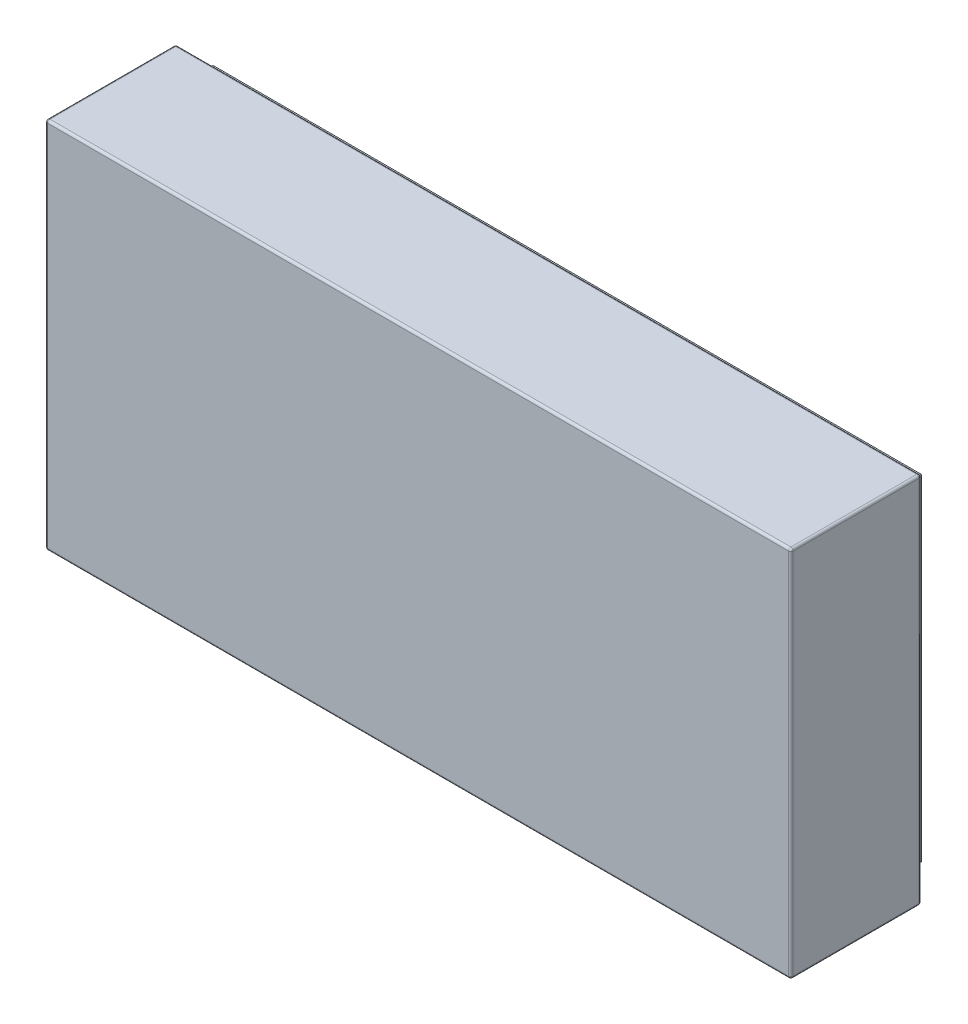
ISO-10303-21;
HEADER;
FILE_DESCRIPTION(('STEP AP214'),'2;1');
FILE_NAME('part.step','',(''),(''),'','','');
FILE_SCHEMA(('AUTOMOTIVE_DESIGN { 1 0 10303 214 1 1 1 1 }'));
ENDSEC;
DATA;
#1=APPLICATION_CONTEXT('core data for automotive mechanical design processes');
#2=APPLICATION_PROTOCOL_DEFINITION('international standard','automotive_design',2000,#1);
#3=PRODUCT_CONTEXT('',#1,'mechanical');
#4=PRODUCT('Part','Part','',(#3));
#5=PRODUCT_RELATED_PRODUCT_CATEGORY('part','',(#4));
#6=PRODUCT_DEFINITION_FORMATION('','',#4);
#7=PRODUCT_DEFINITION_CONTEXT('part definition',#1,'design');
#8=PRODUCT_DEFINITION('design','',#6,#7);
#9=PRODUCT_DEFINITION_SHAPE('','',#8);
#10=(LENGTH_UNIT() NAMED_UNIT(*) SI_UNIT(.MILLI.,.METRE.));
#11=(NAMED_UNIT(*) PLANE_ANGLE_UNIT() SI_UNIT($,.RADIAN.));
#12=(NAMED_UNIT(*) SI_UNIT($,.STERADIAN.) SOLID_ANGLE_UNIT());
#13=UNCERTAINTY_MEASURE_WITH_UNIT(LENGTH_MEASURE(1.E-05),#10,'distance_accuracy_value','');
#14=(GEOMETRIC_REPRESENTATION_CONTEXT(3) GLOBAL_UNCERTAINTY_ASSIGNED_CONTEXT((#13)) GLOBAL_UNIT_ASSIGNED_CONTEXT((#10,
#11,#12)) REPRESENTATION_CONTEXT('',''));
#15=CARTESIAN_POINT('',(0.,0.,0.));
#16=DIRECTION('',(0.,0.,1.));
#17=DIRECTION('',(1.,0.,0.));
#18=AXIS2_PLACEMENT_3D('',#15,#16,#17);
#19=CARTESIAN_POINT('',(0.,8.,0.));
#20=DIRECTION('',(0.,0.,-1.));
#21=DIRECTION('',(-1.,0.,0.));
#22=AXIS2_PLACEMENT_3D('',#19,#20,#21);
#23=PLANE('',#22);
#24=DIRECTION('',(-1.,0.,0.));
#25=VECTOR('',#24,1.);
#26=CARTESIAN_POINT('',(-6.05544306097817,7.6,0.));
#27=LINE('',#26,#25);
#28=CARTESIAN_POINT('',(15.6,7.6,0.));
#29=VERTEX_POINT('',#28);
#30=CARTESIAN_POINT('',(0.400000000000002,7.6,0.));
#31=VERTEX_POINT('',#30);
#32=EDGE_CURVE('E179',#29,#31,#27,.T.);
#33=ORIENTED_EDGE('',*,*,#32,.F.);
#34=DIRECTION('',(0.,-1.,0.));
#35=VECTOR('',#34,1.);
#36=CARTESIAN_POINT('',(15.6,3.99999999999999,0.));
#37=LINE('',#36,#35);
#38=CARTESIAN_POINT('',(15.6,0.400000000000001,0.));
#39=VERTEX_POINT('',#38);
#40=EDGE_CURVE('E184',#29,#39,#37,.T.);
#41=ORIENTED_EDGE('',*,*,#40,.T.);
#42=DIRECTION('',(-1.,0.,0.));
#43=VECTOR('',#42,1.);
#44=CARTESIAN_POINT('',(-6.05544306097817,0.4,0.));
#45=LINE('',#44,#43);
#46=CARTESIAN_POINT('',(0.399999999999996,0.4,0.));
#47=VERTEX_POINT('',#46);
#48=EDGE_CURVE('E164',#39,#47,#45,.T.);
#49=ORIENTED_EDGE('',*,*,#48,.T.);
#50=DIRECTION('',(0.,-1.,0.));
#51=VECTOR('',#50,1.);
#52=CARTESIAN_POINT('',(0.399999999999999,3.99999999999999,0.));
#53=LINE('',#52,#51);
#54=EDGE_CURVE('E175',#31,#47,#53,.T.);
#55=ORIENTED_EDGE('',*,*,#54,.F.);
#56=EDGE_LOOP('',(#33,#41,#49,#55));
#57=FACE_BOUND('',#56,.T.);
#58=DIRECTION('',(0.,-1.,0.));
#59=VECTOR('',#58,1.);
#60=CARTESIAN_POINT('',(14.4,6.4,0.));
#61=LINE('',#60,#59);
#62=CARTESIAN_POINT('',(14.4,6.4,0.));
#63=VERTEX_POINT('',#62);
#64=CARTESIAN_POINT('',(14.4,1.6,0.));
#65=VERTEX_POINT('',#64);
#66=EDGE_CURVE('E200',#63,#65,#61,.T.);
#67=ORIENTED_EDGE('',*,*,#66,.F.);
#68=DIRECTION('',(1.,0.,0.));
#69=VECTOR('',#68,1.);
#70=CARTESIAN_POINT('',(14.4,6.4,0.));
#71=LINE('',#70,#69);
#72=CARTESIAN_POINT('',(1.6,6.4,0.));
#73=VERTEX_POINT('',#72);
#74=EDGE_CURVE('E210',#73,#63,#71,.T.);
#75=ORIENTED_EDGE('',*,*,#74,.F.);
#76=DIRECTION('',(0.,1.,0.));
#77=VECTOR('',#76,1.);
#78=CARTESIAN_POINT('',(1.6,6.4,0.));
#79=LINE('',#78,#77);
#80=CARTESIAN_POINT('',(1.6,1.6,0.));
#81=VERTEX_POINT('',#80);
#82=EDGE_CURVE('E207',#81,#73,#79,.T.);
#83=ORIENTED_EDGE('',*,*,#82,.F.);
#84=DIRECTION('',(-1.,0.,0.));
#85=VECTOR('',#84,1.);
#86=CARTESIAN_POINT('',(14.4,1.6,0.));
#87=LINE('',#86,#85);
#88=EDGE_CURVE('E204',#65,#81,#87,.T.);
#89=ORIENTED_EDGE('',*,*,#88,.F.);
#90=EDGE_LOOP('',(#67,#75,#83,#89));
#91=FACE_BOUND('',#90,.T.);
#92=ADVANCED_FACE('F26',(#57,#91),#23,.T.);
#93=CARTESIAN_POINT('',(14.4,6.4,2.1));
#94=DIRECTION('',(1.,0.,0.));
#95=DIRECTION('',(0.,0.,-1.));
#96=AXIS2_PLACEMENT_3D('',#93,#94,#95);
#97=PLANE('',#96);
#98=ORIENTED_EDGE('',*,*,#66,.T.);
#99=DIRECTION('',(0.,0.,-1.));
#100=VECTOR('',#99,1.);
#101=CARTESIAN_POINT('',(14.4,1.6,2.1));
#102=LINE('',#101,#100);
#103=CARTESIAN_POINT('',(14.4,1.6,2.1));
#104=VERTEX_POINT('',#103);
#105=EDGE_CURVE('E225',#104,#65,#102,.T.);
#106=ORIENTED_EDGE('',*,*,#105,.F.);
#107=DIRECTION('',(0.,-1.,0.));
#108=VECTOR('',#107,1.);
#109=CARTESIAN_POINT('',(14.4,6.4,2.1));
#110=LINE('',#109,#108);
#111=CARTESIAN_POINT('',(14.4,6.4,2.1));
#112=VERTEX_POINT('',#111);
#113=EDGE_CURVE('E213',#112,#104,#110,.T.);
#114=ORIENTED_EDGE('',*,*,#113,.F.);
#115=DIRECTION('',(0.,0.,-1.));
#116=VECTOR('',#115,1.);
#117=CARTESIAN_POINT('',(14.4,6.4,2.1));
#118=LINE('',#117,#116);
#119=EDGE_CURVE('E226',#112,#63,#118,.T.);
#120=ORIENTED_EDGE('',*,*,#119,.T.);
#121=EDGE_LOOP('',(#98,#106,#114,#120));
#122=FACE_BOUND('',#121,.T.);
#123=ADVANCED_FACE('F385',(#122),#97,.F.);
#124=CARTESIAN_POINT('',(14.4,6.4,2.1));
#125=DIRECTION('',(0.,1.,0.));
#126=DIRECTION('',(0.,0.,1.));
#127=AXIS2_PLACEMENT_3D('',#124,#125,#126);
#128=PLANE('',#127);
#129=ORIENTED_EDGE('',*,*,#74,.T.);
#130=ORIENTED_EDGE('',*,*,#119,.F.);
#131=DIRECTION('',(1.,0.,0.));
#132=VECTOR('',#131,1.);
#133=CARTESIAN_POINT('',(14.4,6.4,2.1));
#134=LINE('',#133,#132);
#135=CARTESIAN_POINT('',(1.6,6.4,2.1));
#136=VERTEX_POINT('',#135);
#137=EDGE_CURVE('E222',#136,#112,#134,.T.);
#138=ORIENTED_EDGE('',*,*,#137,.F.);
#139=DIRECTION('',(0.,0.,-1.));
#140=VECTOR('',#139,1.);
#141=CARTESIAN_POINT('',(1.6,6.4,2.1));
#142=LINE('',#141,#140);
#143=EDGE_CURVE('E229',#136,#73,#142,.T.);
#144=ORIENTED_EDGE('',*,*,#143,.T.);
#145=EDGE_LOOP('',(#129,#130,#138,#144));
#146=FACE_BOUND('',#145,.T.);
#147=ADVANCED_FACE('F392',(#146),#128,.F.);
#148=CARTESIAN_POINT('',(1.6,6.4,2.1));
#149=DIRECTION('',(-1.,0.,0.));
#150=DIRECTION('',(0.,-1.,0.));
#151=AXIS2_PLACEMENT_3D('',#148,#149,#150);
#152=PLANE('',#151);
#153=ORIENTED_EDGE('',*,*,#82,.T.);
#154=ORIENTED_EDGE('',*,*,#143,.F.);
#155=DIRECTION('',(0.,1.,0.));
#156=VECTOR('',#155,1.);
#157=CARTESIAN_POINT('',(1.6,6.4,2.1));
#158=LINE('',#157,#156);
#159=CARTESIAN_POINT('',(1.6,1.6,2.1));
#160=VERTEX_POINT('',#159);
#161=EDGE_CURVE('E219',#160,#136,#158,.T.);
#162=ORIENTED_EDGE('',*,*,#161,.F.);
#163=DIRECTION('',(0.,0.,-1.));
#164=VECTOR('',#163,1.);
#165=CARTESIAN_POINT('',(1.6,1.6,2.1));
#166=LINE('',#165,#164);
#167=EDGE_CURVE('E231',#160,#81,#166,.T.);
#168=ORIENTED_EDGE('',*,*,#167,.T.);
#169=EDGE_LOOP('',(#153,#154,#162,#168));
#170=FACE_BOUND('',#169,.T.);
#171=ADVANCED_FACE('F636',(#170),#152,.F.);
#172=CARTESIAN_POINT('',(14.4,1.6,2.1));
#173=DIRECTION('',(0.,-1.,0.));
#174=DIRECTION('',(0.,0.,-1.));
#175=AXIS2_PLACEMENT_3D('',#172,#173,#174);
#176=PLANE('',#175);
#177=ORIENTED_EDGE('',*,*,#88,.T.);
#178=ORIENTED_EDGE('',*,*,#167,.F.);
#179=DIRECTION('',(-1.,0.,0.));
#180=VECTOR('',#179,1.);
#181=CARTESIAN_POINT('',(14.4,1.6,2.1));
#182=LINE('',#181,#180);
#183=EDGE_CURVE('E216',#104,#160,#182,.T.);
#184=ORIENTED_EDGE('',*,*,#183,.F.);
#185=ORIENTED_EDGE('',*,*,#105,.T.);
#186=EDGE_LOOP('',(#177,#178,#184,#185));
#187=FACE_BOUND('',#186,.T.);
#188=ADVANCED_FACE('F625',(#187),#176,.F.);
#189=CARTESIAN_POINT('',(14.4,1.6,2.1));
#190=DIRECTION('',(0.,0.,-1.));
#191=DIRECTION('',(-1.,0.,0.));
#192=AXIS2_PLACEMENT_3D('',#189,#190,#191);
#193=PLANE('',#192);
#194=CARTESIAN_POINT('',(8.,4.,2.1));
#195=DIRECTION('',(0.,0.,-1.));
#196=DIRECTION('',(-1.,0.,0.));
#197=AXIS2_PLACEMENT_3D('',#194,#195,#196);
#198=CIRCLE('',#197,1.1);
#199=CARTESIAN_POINT('',(6.9,4.,2.1));
#200=VERTEX_POINT('',#199);
#201=EDGE_CURVE('E616',#200,#200,#198,.T.);
#202=ORIENTED_EDGE('',*,*,#201,.F.);
#203=EDGE_LOOP('',(#202));
#204=FACE_BOUND('',#203,.T.);
#205=ORIENTED_EDGE('',*,*,#113,.T.);
#206=ORIENTED_EDGE('',*,*,#183,.T.);
#207=ORIENTED_EDGE('',*,*,#161,.T.);
#208=ORIENTED_EDGE('',*,*,#137,.T.);
#209=EDGE_LOOP('',(#205,#206,#207,#208));
#210=FACE_BOUND('',#209,.T.);
#211=ADVANCED_FACE('F623',(#204,#210),#193,.T.);
#212=CARTESIAN_POINT('',(-6.05544306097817,7.6,0.4));
#213=DIRECTION('',(0.,-1.,0.));
#214=DIRECTION('',(0.,0.,-1.));
#215=AXIS2_PLACEMENT_3D('',#212,#213,#214);
#216=PLANE('',#215);
#217=ORIENTED_EDGE('',*,*,#32,.T.);
#218=DIRECTION('',(0.,0.,-1.));
#219=VECTOR('',#218,1.);
#220=CARTESIAN_POINT('',(0.400000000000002,7.6,0.4));
#221=LINE('',#220,#219);
#222=CARTESIAN_POINT('',(0.400000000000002,7.6,0.4));
#223=VERTEX_POINT('',#222);
#224=EDGE_CURVE('E171',#223,#31,#221,.T.);
#225=ORIENTED_EDGE('',*,*,#224,.F.);
#226=DIRECTION('',(-1.,0.,0.));
#227=VECTOR('',#226,1.);
#228=CARTESIAN_POINT('',(-6.05544306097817,7.6,0.4));
#229=LINE('',#228,#227);
#230=CARTESIAN_POINT('',(15.6,7.6,0.4));
#231=VERTEX_POINT('',#230);
#232=EDGE_CURVE('E186',#231,#223,#229,.T.);
#233=ORIENTED_EDGE('',*,*,#232,.F.);
#234=DIRECTION('',(0.,0.,-1.));
#235=VECTOR('',#234,1.);
#236=CARTESIAN_POINT('',(15.6,7.6,0.4));
#237=LINE('',#236,#235);
#238=EDGE_CURVE('E198',#231,#29,#237,.T.);
#239=ORIENTED_EDGE('',*,*,#238,.T.);
#240=EDGE_LOOP('',(#217,#225,#233,#239));
#241=FACE_BOUND('',#240,.T.);
#242=ADVANCED_FACE('F362',(#241),#216,.F.);
#243=CARTESIAN_POINT('',(15.6,3.99999999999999,0.4));
#244=DIRECTION('',(1.,0.,0.));
#245=DIRECTION('',(0.,1.,0.));
#246=AXIS2_PLACEMENT_3D('',#243,#244,#245);
#247=PLANE('',#246);
#248=ORIENTED_EDGE('',*,*,#40,.F.);
#249=ORIENTED_EDGE('',*,*,#238,.F.);
#250=DIRECTION('',(0.,-1.,0.));
#251=VECTOR('',#250,1.);
#252=CARTESIAN_POINT('',(15.6,3.99999999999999,0.4));
#253=LINE('',#252,#251);
#254=CARTESIAN_POINT('',(15.6,0.400000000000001,0.4));
#255=VERTEX_POINT('',#254);
#256=EDGE_CURVE('E195',#231,#255,#253,.T.);
#257=ORIENTED_EDGE('',*,*,#256,.T.);
#258=DIRECTION('',(0.,0.,-1.));
#259=VECTOR('',#258,1.);
#260=CARTESIAN_POINT('',(15.6,0.400000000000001,0.4));
#261=LINE('',#260,#259);
#262=EDGE_CURVE('E170',#255,#39,#261,.T.);
#263=ORIENTED_EDGE('',*,*,#262,.T.);
#264=EDGE_LOOP('',(#248,#249,#257,#263));
#265=FACE_BOUND('',#264,.T.);
#266=ADVANCED_FACE('F366',(#265),#247,.T.);
#267=CARTESIAN_POINT('',(-6.05544306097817,0.4,0.4));
#268=DIRECTION('',(0.,-1.,0.));
#269=DIRECTION('',(0.,0.,-1.));
#270=AXIS2_PLACEMENT_3D('',#267,#268,#269);
#271=PLANE('',#270);
#272=ORIENTED_EDGE('',*,*,#48,.F.);
#273=ORIENTED_EDGE('',*,*,#262,.F.);
#274=DIRECTION('',(-1.,0.,0.));
#275=VECTOR('',#274,1.);
#276=CARTESIAN_POINT('',(-6.05544306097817,0.4,0.4));
#277=LINE('',#276,#275);
#278=CARTESIAN_POINT('',(0.399999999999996,0.4,0.4));
#279=VERTEX_POINT('',#278);
#280=EDGE_CURVE('E166',#255,#279,#277,.T.);
#281=ORIENTED_EDGE('',*,*,#280,.T.);
#282=DIRECTION('',(0.,0.,-1.));
#283=VECTOR('',#282,1.);
#284=CARTESIAN_POINT('',(0.399999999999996,0.4,0.4));
#285=LINE('',#284,#283);
#286=EDGE_CURVE('E159',#279,#47,#285,.T.);
#287=ORIENTED_EDGE('',*,*,#286,.T.);
#288=EDGE_LOOP('',(#272,#273,#281,#287));
#289=FACE_BOUND('',#288,.T.);
#290=ADVANCED_FACE('F161',(#289),#271,.T.);
#291=CARTESIAN_POINT('',(0.399999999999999,3.99999999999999,0.4));
#292=DIRECTION('',(1.,0.,0.));
#293=DIRECTION('',(0.,1.,0.));
#294=AXIS2_PLACEMENT_3D('',#291,#292,#293);
#295=PLANE('',#294);
#296=ORIENTED_EDGE('',*,*,#54,.T.);
#297=ORIENTED_EDGE('',*,*,#286,.F.);
#298=DIRECTION('',(0.,-1.,0.));
#299=VECTOR('',#298,1.);
#300=CARTESIAN_POINT('',(0.399999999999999,3.99999999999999,0.4));
#301=LINE('',#300,#299);
#302=EDGE_CURVE('E192',#223,#279,#301,.T.);
#303=ORIENTED_EDGE('',*,*,#302,.F.);
#304=ORIENTED_EDGE('',*,*,#224,.T.);
#305=EDGE_LOOP('',(#296,#297,#303,#304));
#306=FACE_BOUND('',#305,.T.);
#307=ADVANCED_FACE('F176',(#306),#295,.F.);
#308=CARTESIAN_POINT('',(-6.05544306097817,4.,0.4));
#309=DIRECTION('',(0.,0.,-1.));
#310=DIRECTION('',(-1.,0.,0.));
#311=AXIS2_PLACEMENT_3D('',#308,#309,#310);
#312=PLANE('',#311);
#313=DIRECTION('',(0.,-1.,0.));
#314=VECTOR('',#313,1.);
#315=CARTESIAN_POINT('',(0.0500000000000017,8.,0.4));
#316=LINE('',#315,#314);
#317=CARTESIAN_POINT('',(0.05,0.0499999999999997,0.4));
#318=VERTEX_POINT('',#317);
#319=CARTESIAN_POINT('',(0.0500000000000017,7.95,0.4));
#320=VERTEX_POINT('',#319);
#321=EDGE_CURVE('E280',#318,#320,#316,.F.);
#322=ORIENTED_EDGE('',*,*,#321,.T.);
#323=DIRECTION('',(-1.,0.,0.));
#324=VECTOR('',#323,1.);
#325=CARTESIAN_POINT('',(15.95,7.95,0.4));
#326=LINE('',#325,#324);
#327=CARTESIAN_POINT('',(15.95,7.95,0.4));
#328=VERTEX_POINT('',#327);
#329=EDGE_CURVE('E310',#320,#328,#326,.F.);
#330=ORIENTED_EDGE('',*,*,#329,.T.);
#331=DIRECTION('',(0.,1.,0.));
#332=VECTOR('',#331,1.);
#333=CARTESIAN_POINT('',(15.95,0.0499999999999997,0.4));
#334=LINE('',#333,#332);
#335=CARTESIAN_POINT('',(15.95,0.05,0.4));
#336=VERTEX_POINT('',#335);
#337=EDGE_CURVE('E308',#328,#336,#334,.F.);
#338=ORIENTED_EDGE('',*,*,#337,.T.);
#339=DIRECTION('',(1.,0.,0.));
#340=VECTOR('',#339,1.);
#341=CARTESIAN_POINT('',(0.0499999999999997,0.05,0.4));
#342=LINE('',#341,#340);
#343=EDGE_CURVE('E306',#336,#318,#342,.F.);
#344=ORIENTED_EDGE('',*,*,#343,.T.);
#345=EDGE_LOOP('',(#322,#330,#338,#344));
#346=FACE_BOUND('',#345,.T.);
#347=ORIENTED_EDGE('',*,*,#232,.T.);
#348=ORIENTED_EDGE('',*,*,#302,.T.);
#349=ORIENTED_EDGE('',*,*,#280,.F.);
#350=ORIENTED_EDGE('',*,*,#256,.F.);
#351=EDGE_LOOP('',(#347,#348,#349,#350));
#352=FACE_BOUND('',#351,.T.);
#353=ADVANCED_FACE('F368',(#346,#352),#312,.T.);
#354=CARTESIAN_POINT('',(0.,8.,3.2));
#355=DIRECTION('',(0.,0.,-1.));
#356=DIRECTION('',(-1.,0.,0.));
#357=AXIS2_PLACEMENT_3D('',#354,#355,#356);
#358=PLANE('',#357);
#359=DIRECTION('',(0.,1.,0.));
#360=VECTOR('',#359,1.);
#361=CARTESIAN_POINT('',(15.95,8.,3.2));
#362=LINE('',#361,#360);
#363=CARTESIAN_POINT('',(15.95,0.0499999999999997,3.2));
#364=VERTEX_POINT('',#363);
#365=CARTESIAN_POINT('',(15.95,7.95,3.2));
#366=VERTEX_POINT('',#365);
#367=EDGE_CURVE('E240',#364,#366,#362,.T.);
#368=ORIENTED_EDGE('',*,*,#367,.T.);
#369=DIRECTION('',(-1.,0.,0.));
#370=VECTOR('',#369,1.);
#371=CARTESIAN_POINT('',(0.,7.95,3.2));
#372=LINE('',#371,#370);
#373=CARTESIAN_POINT('',(0.0500000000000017,7.95,3.2));
#374=VERTEX_POINT('',#373);
#375=EDGE_CURVE('E243',#366,#374,#372,.T.);
#376=ORIENTED_EDGE('',*,*,#375,.T.);
#377=DIRECTION('',(0.,-1.,0.));
#378=VECTOR('',#377,1.);
#379=CARTESIAN_POINT('',(0.0500000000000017,8.,3.2));
#380=LINE('',#379,#378);
#381=CARTESIAN_POINT('',(0.05,0.0499999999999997,3.2));
#382=VERTEX_POINT('',#381);
#383=EDGE_CURVE('E228',#374,#382,#380,.T.);
#384=ORIENTED_EDGE('',*,*,#383,.T.);
#385=DIRECTION('',(1.,0.,0.));
#386=VECTOR('',#385,1.);
#387=CARTESIAN_POINT('',(0.,0.0499999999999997,3.2));
#388=LINE('',#387,#386);
#389=EDGE_CURVE('E237',#382,#364,#388,.T.);
#390=ORIENTED_EDGE('',*,*,#389,.T.);
#391=EDGE_LOOP('',(#368,#376,#384,#390));
#392=FACE_BOUND('',#391,.T.);
#393=ADVANCED_FACE('F370',(#392),#358,.F.);
#394=CARTESIAN_POINT('',(0.,8.,3.2));
#395=DIRECTION('',(0.,-1.,0.));
#396=DIRECTION('',(0.,0.,-1.));
#397=AXIS2_PLACEMENT_3D('',#394,#395,#396);
#398=PLANE('',#397);
#399=DIRECTION('',(0.,0.,-1.));
#400=VECTOR('',#399,1.);
#401=CARTESIAN_POINT('',(15.95,8.,3.2));
#402=LINE('',#401,#400);
#403=CARTESIAN_POINT('',(15.95,8.,3.15));
#404=VERTEX_POINT('',#403);
#405=CARTESIAN_POINT('',(15.95,8.,0.45));
#406=VERTEX_POINT('',#405);
#407=EDGE_CURVE('E288',#404,#406,#402,.T.);
#408=ORIENTED_EDGE('',*,*,#407,.T.);
#409=DIRECTION('',(-1.,0.,0.));
#410=VECTOR('',#409,1.);
#411=CARTESIAN_POINT('',(0.0500000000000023,8.,0.45));
#412=LINE('',#411,#410);
#413=CARTESIAN_POINT('',(0.0500000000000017,8.,0.45));
#414=VERTEX_POINT('',#413);
#415=EDGE_CURVE('E304',#406,#414,#412,.T.);
#416=ORIENTED_EDGE('',*,*,#415,.T.);
#417=DIRECTION('',(0.,0.,-1.));
#418=VECTOR('',#417,1.);
#419=CARTESIAN_POINT('',(0.0500000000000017,8.,3.2));
#420=LINE('',#419,#418);
#421=CARTESIAN_POINT('',(0.0500000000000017,8.,3.15));
#422=VERTEX_POINT('',#421);
#423=EDGE_CURVE('E291',#414,#422,#420,.F.);
#424=ORIENTED_EDGE('',*,*,#423,.T.);
#425=DIRECTION('',(-1.,0.,0.));
#426=VECTOR('',#425,1.);
#427=CARTESIAN_POINT('',(0.,8.,3.15));
#428=LINE('',#427,#426);
#429=EDGE_CURVE('E246',#422,#404,#428,.F.);
#430=ORIENTED_EDGE('',*,*,#429,.T.);
#431=EDGE_LOOP('',(#408,#416,#424,#430));
#432=FACE_BOUND('',#431,.T.);
#433=ADVANCED_FACE('F377',(#432),#398,.F.);
#434=CARTESIAN_POINT('',(16.,0.,3.2));
#435=DIRECTION('',(-1.,0.,0.));
#436=DIRECTION('',(0.,0.,1.));
#437=AXIS2_PLACEMENT_3D('',#434,#435,#436);
#438=PLANE('',#437);
#439=DIRECTION('',(0.,0.,-1.));
#440=VECTOR('',#439,1.);
#441=CARTESIAN_POINT('',(16.,0.05,3.2));
#442=LINE('',#441,#440);
#443=CARTESIAN_POINT('',(16.,0.05,3.15));
#444=VERTEX_POINT('',#443);
#445=CARTESIAN_POINT('',(16.,0.05,0.45));
#446=VERTEX_POINT('',#445);
#447=EDGE_CURVE('E285',#444,#446,#442,.T.);
#448=ORIENTED_EDGE('',*,*,#447,.T.);
#449=DIRECTION('',(0.,1.,0.));
#450=VECTOR('',#449,1.);
#451=CARTESIAN_POINT('',(16.,7.95,0.45));
#452=LINE('',#451,#450);
#453=CARTESIAN_POINT('',(16.,7.95,0.45));
#454=VERTEX_POINT('',#453);
#455=EDGE_CURVE('E314',#446,#454,#452,.T.);
#456=ORIENTED_EDGE('',*,*,#455,.T.);
#457=DIRECTION('',(0.,0.,-1.));
#458=VECTOR('',#457,1.);
#459=CARTESIAN_POINT('',(16.,7.95,3.2));
#460=LINE('',#459,#458);
#461=CARTESIAN_POINT('',(16.,7.95,3.15));
#462=VERTEX_POINT('',#461);
#463=EDGE_CURVE('E283',#454,#462,#460,.F.);
#464=ORIENTED_EDGE('',*,*,#463,.T.);
#465=DIRECTION('',(0.,1.,0.));
#466=VECTOR('',#465,1.);
#467=CARTESIAN_POINT('',(16.,0.,3.15));
#468=LINE('',#467,#466);
#469=EDGE_CURVE('E249',#462,#444,#468,.F.);
#470=ORIENTED_EDGE('',*,*,#469,.T.);
#471=EDGE_LOOP('',(#448,#456,#464,#470));
#472=FACE_BOUND('',#471,.T.);
#473=ADVANCED_FACE('F329',(#472),#438,.F.);
#474=CARTESIAN_POINT('',(0.,0.,3.2));
#475=DIRECTION('',(0.,1.,0.));
#476=DIRECTION('',(0.,0.,1.));
#477=AXIS2_PLACEMENT_3D('',#474,#475,#476);
#478=PLANE('',#477);
#479=DIRECTION('',(0.,0.,-1.));
#480=VECTOR('',#479,1.);
#481=CARTESIAN_POINT('',(0.05,0.,3.2));
#482=LINE('',#481,#480);
#483=CARTESIAN_POINT('',(0.05,0.,3.15));
#484=VERTEX_POINT('',#483);
#485=CARTESIAN_POINT('',(0.05,0.,0.45));
#486=VERTEX_POINT('',#485);
#487=EDGE_CURVE('E41',#484,#486,#482,.T.);
#488=ORIENTED_EDGE('',*,*,#487,.T.);
#489=DIRECTION('',(1.,0.,0.));
#490=VECTOR('',#489,1.);
#491=CARTESIAN_POINT('',(15.95,0.,0.45));
#492=LINE('',#491,#490);
#493=CARTESIAN_POINT('',(15.95,0.,0.45));
#494=VERTEX_POINT('',#493);
#495=EDGE_CURVE('E34',#486,#494,#492,.T.);
#496=ORIENTED_EDGE('',*,*,#495,.T.);
#497=DIRECTION('',(0.,0.,-1.));
#498=VECTOR('',#497,1.);
#499=CARTESIAN_POINT('',(15.95,0.,3.2));
#500=LINE('',#499,#498);
#501=CARTESIAN_POINT('',(15.95,0.,3.15));
#502=VERTEX_POINT('',#501);
#503=EDGE_CURVE('E278',#494,#502,#500,.F.);
#504=ORIENTED_EDGE('',*,*,#503,.T.);
#505=DIRECTION('',(1.,0.,0.));
#506=VECTOR('',#505,1.);
#507=CARTESIAN_POINT('',(0.,0.,3.15));
#508=LINE('',#507,#506);
#509=EDGE_CURVE('E252',#502,#484,#508,.F.);
#510=ORIENTED_EDGE('',*,*,#509,.T.);
#511=EDGE_LOOP('',(#488,#496,#504,#510));
#512=FACE_BOUND('',#511,.T.);
#513=ADVANCED_FACE('F401',(#512),#478,.F.);
#514=CARTESIAN_POINT('',(0.,0.,3.2));
#515=DIRECTION('',(1.,0.,0.));
#516=DIRECTION('',(0.,1.,0.));
#517=AXIS2_PLACEMENT_3D('',#514,#515,#516);
#518=PLANE('',#517);
#519=DIRECTION('',(0.,-1.,0.));
#520=VECTOR('',#519,1.);
#521=CARTESIAN_POINT('',(0.,0.,0.45));
#522=LINE('',#521,#520);
#523=CARTESIAN_POINT('',(0.,7.95,0.45));
#524=VERTEX_POINT('',#523);
#525=CARTESIAN_POINT('',(0.,0.05,0.45));
#526=VERTEX_POINT('',#525);
#527=EDGE_CURVE('E275',#524,#526,#522,.T.);
#528=ORIENTED_EDGE('',*,*,#527,.T.);
#529=DIRECTION('',(0.,0.,-1.));
#530=VECTOR('',#529,1.);
#531=CARTESIAN_POINT('',(0.,0.05,3.2));
#532=LINE('',#531,#530);
#533=CARTESIAN_POINT('',(0.,0.05,3.15));
#534=VERTEX_POINT('',#533);
#535=EDGE_CURVE('E11',#526,#534,#532,.F.);
#536=ORIENTED_EDGE('',*,*,#535,.T.);
#537=DIRECTION('',(0.,-1.,0.));
#538=VECTOR('',#537,1.);
#539=CARTESIAN_POINT('',(0.,0.,3.15));
#540=LINE('',#539,#538);
#541=CARTESIAN_POINT('',(0.,7.95,3.15));
#542=VERTEX_POINT('',#541);
#543=EDGE_CURVE('E254',#534,#542,#540,.F.);
#544=ORIENTED_EDGE('',*,*,#543,.T.);
#545=DIRECTION('',(0.,0.,-1.));
#546=VECTOR('',#545,1.);
#547=CARTESIAN_POINT('',(0.,7.95,3.2));
#548=LINE('',#547,#546);
#549=EDGE_CURVE('E272',#542,#524,#548,.T.);
#550=ORIENTED_EDGE('',*,*,#549,.T.);
#551=EDGE_LOOP('',(#528,#536,#544,#550));
#552=FACE_BOUND('',#551,.T.);
#553=ADVANCED_FACE('F28',(#552),#518,.F.);
#554=CARTESIAN_POINT('',(0.,0.0499999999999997,3.15));
#555=DIRECTION('',(1.,0.,0.));
#556=DIRECTION('',(0.,0.,-1.));
#557=AXIS2_PLACEMENT_3D('',#554,#555,#556);
#558=CYLINDRICAL_SURFACE('',#557,0.05);
#559=ORIENTED_EDGE('',*,*,#389,.F.);
#560=CARTESIAN_POINT('',(0.05,0.0499999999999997,3.15));
#561=DIRECTION('',(1.,0.,0.));
#562=DIRECTION('',(0.,0.,-1.));
#563=AXIS2_PLACEMENT_3D('',#560,#561,#562);
#564=CIRCLE('',#563,0.05);
#565=EDGE_CURVE('E296',#382,#484,#564,.T.);
#566=ORIENTED_EDGE('',*,*,#565,.T.);
#567=ORIENTED_EDGE('',*,*,#509,.F.);
#568=CARTESIAN_POINT('',(15.95,0.0499999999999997,3.15));
#569=DIRECTION('',(1.,0.,0.));
#570=DIRECTION('',(0.,0.,-1.));
#571=AXIS2_PLACEMENT_3D('',#568,#569,#570);
#572=CIRCLE('',#571,0.05);
#573=EDGE_CURVE('E261',#502,#364,#572,.F.);
#574=ORIENTED_EDGE('',*,*,#573,.T.);
#575=EDGE_LOOP('',(#559,#566,#567,#574));
#576=FACE_BOUND('',#575,.T.);
#577=ADVANCED_FACE('F406',(#576),#558,.T.);
#578=CARTESIAN_POINT('',(15.95,8.,3.15));
#579=DIRECTION('',(0.,1.,0.));
#580=DIRECTION('',(0.,0.,1.));
#581=AXIS2_PLACEMENT_3D('',#578,#579,#580);
#582=CYLINDRICAL_SURFACE('',#581,0.05);
#583=ORIENTED_EDGE('',*,*,#367,.F.);
#584=CARTESIAN_POINT('',(15.95,0.0499999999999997,3.15));
#585=DIRECTION('',(0.,1.,0.));
#586=DIRECTION('',(0.,0.,1.));
#587=AXIS2_PLACEMENT_3D('',#584,#585,#586);
#588=CIRCLE('',#587,0.05);
#589=EDGE_CURVE('E258',#364,#444,#588,.T.);
#590=ORIENTED_EDGE('',*,*,#589,.T.);
#591=ORIENTED_EDGE('',*,*,#469,.F.);
#592=CARTESIAN_POINT('',(15.95,7.95,3.15));
#593=DIRECTION('',(0.,1.,0.));
#594=DIRECTION('',(0.,0.,1.));
#595=AXIS2_PLACEMENT_3D('',#592,#593,#594);
#596=CIRCLE('',#595,0.05);
#597=EDGE_CURVE('E256',#462,#366,#596,.F.);
#598=ORIENTED_EDGE('',*,*,#597,.T.);
#599=EDGE_LOOP('',(#583,#590,#591,#598));
#600=FACE_BOUND('',#599,.T.);
#601=ADVANCED_FACE('F411',(#600),#582,.T.);
#602=CARTESIAN_POINT('',(0.0500000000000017,8.,3.15));
#603=DIRECTION('',(0.,-1.,0.));
#604=DIRECTION('',(1.,0.,0.));
#605=AXIS2_PLACEMENT_3D('',#602,#603,#604);
#606=CYLINDRICAL_SURFACE('',#605,0.05);
#607=ORIENTED_EDGE('',*,*,#543,.F.);
#608=CARTESIAN_POINT('',(0.05,0.0499999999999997,3.15));
#609=DIRECTION('',(0.,-1.,0.));
#610=DIRECTION('',(1.,0.,0.));
#611=AXIS2_PLACEMENT_3D('',#608,#609,#610);
#612=CIRCLE('',#611,0.05);
#613=EDGE_CURVE('E293',#534,#382,#612,.F.);
#614=ORIENTED_EDGE('',*,*,#613,.T.);
#615=ORIENTED_EDGE('',*,*,#383,.F.);
#616=CARTESIAN_POINT('',(0.0500000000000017,7.95,3.15));
#617=DIRECTION('',(0.,-1.,0.));
#618=DIRECTION('',(1.,0.,0.));
#619=AXIS2_PLACEMENT_3D('',#616,#617,#618);
#620=CIRCLE('',#619,0.05);
#621=EDGE_CURVE('E269',#374,#542,#620,.T.);
#622=ORIENTED_EDGE('',*,*,#621,.T.);
#623=EDGE_LOOP('',(#607,#614,#615,#622));
#624=FACE_BOUND('',#623,.T.);
#625=ADVANCED_FACE('F440',(#624),#606,.T.);
#626=CARTESIAN_POINT('',(0.,7.95,3.15));
#627=DIRECTION('',(-1.,0.,0.));
#628=DIRECTION('',(0.,0.,1.));
#629=AXIS2_PLACEMENT_3D('',#626,#627,#628);
#630=CYLINDRICAL_SURFACE('',#629,0.05);
#631=ORIENTED_EDGE('',*,*,#429,.F.);
#632=CARTESIAN_POINT('',(0.0500000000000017,7.95,3.15));
#633=DIRECTION('',(-1.,0.,0.));
#634=DIRECTION('',(0.,0.,1.));
#635=AXIS2_PLACEMENT_3D('',#632,#633,#634);
#636=CIRCLE('',#635,0.05);
#637=EDGE_CURVE('E266',#422,#374,#636,.F.);
#638=ORIENTED_EDGE('',*,*,#637,.T.);
#639=ORIENTED_EDGE('',*,*,#375,.F.);
#640=CARTESIAN_POINT('',(15.95,7.95,3.15));
#641=DIRECTION('',(-1.,0.,0.));
#642=DIRECTION('',(0.,0.,1.));
#643=AXIS2_PLACEMENT_3D('',#640,#641,#642);
#644=CIRCLE('',#643,0.05);
#645=EDGE_CURVE('E263',#366,#404,#644,.T.);
#646=ORIENTED_EDGE('',*,*,#645,.T.);
#647=EDGE_LOOP('',(#631,#638,#639,#646));
#648=FACE_BOUND('',#647,.T.);
#649=ADVANCED_FACE('F454',(#648),#630,.T.);
#650=CARTESIAN_POINT('',(15.95,0.05,3.2));
#651=DIRECTION('',(0.,0.,-1.));
#652=DIRECTION('',(-1.,0.,0.));
#653=AXIS2_PLACEMENT_3D('',#650,#651,#652);
#654=CYLINDRICAL_SURFACE('',#653,0.05);
#655=ORIENTED_EDGE('',*,*,#503,.F.);
#656=CARTESIAN_POINT('',(15.95,0.05,0.45));
#657=DIRECTION('',(0.,0.,-1.));
#658=DIRECTION('',(-1.,0.,0.));
#659=AXIS2_PLACEMENT_3D('',#656,#657,#658);
#660=CIRCLE('',#659,0.05);
#661=EDGE_CURVE('E316',#494,#446,#660,.F.);
#662=ORIENTED_EDGE('',*,*,#661,.T.);
#663=ORIENTED_EDGE('',*,*,#447,.F.);
#664=CARTESIAN_POINT('',(15.95,0.05,3.15));
#665=DIRECTION('',(0.,0.,1.));
#666=DIRECTION('',(1.,0.,0.));
#667=AXIS2_PLACEMENT_3D('',#664,#665,#666);
#668=CIRCLE('',#667,0.05);
#669=EDGE_CURVE('E360',#502,#444,#668,.T.);
#670=ORIENTED_EDGE('',*,*,#669,.F.);
#671=EDGE_LOOP('',(#655,#662,#663,#670));
#672=FACE_BOUND('',#671,.T.);
#673=ADVANCED_FACE('F321',(#672),#654,.T.);
#674=CARTESIAN_POINT('',(15.95,0.0499999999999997,3.15));
#675=DIRECTION('',(0.,0.,1.));
#676=DIRECTION('',(1.,0.,0.));
#677=AXIS2_PLACEMENT_3D('',#674,#675,#676);
#678=SPHERICAL_SURFACE('',#677,0.05);
#679=ORIENTED_EDGE('',*,*,#589,.F.);
#680=ORIENTED_EDGE('',*,*,#573,.F.);
#681=ORIENTED_EDGE('',*,*,#669,.T.);
#682=EDGE_LOOP('',(#679,#680,#681));
#683=FACE_BOUND('',#682,.T.);
#684=ADVANCED_FACE('F448',(#683),#678,.T.);
#685=CARTESIAN_POINT('',(0.05,0.,0.45));
#686=DIRECTION('',(0.,1.,0.));
#687=DIRECTION('',(-1.,0.,0.));
#688=AXIS2_PLACEMENT_3D('',#685,#686,#687);
#689=CYLINDRICAL_SURFACE('',#688,0.05);
#690=ORIENTED_EDGE('',*,*,#527,.F.);
#691=CARTESIAN_POINT('',(0.0500000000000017,7.95,0.45));
#692=DIRECTION('',(0.,1.,0.));
#693=DIRECTION('',(-1.,0.,0.));
#694=AXIS2_PLACEMENT_3D('',#691,#692,#693);
#695=CIRCLE('',#694,0.05);
#696=EDGE_CURVE('E302',#524,#320,#695,.F.);
#697=ORIENTED_EDGE('',*,*,#696,.T.);
#698=ORIENTED_EDGE('',*,*,#321,.F.);
#699=CARTESIAN_POINT('',(0.05,0.05,0.45));
#700=DIRECTION('',(0.,1.,0.));
#701=DIRECTION('',(-1.,0.,0.));
#702=AXIS2_PLACEMENT_3D('',#699,#700,#701);
#703=CIRCLE('',#702,0.05);
#704=EDGE_CURVE('E300',#318,#526,#703,.T.);
#705=ORIENTED_EDGE('',*,*,#704,.T.);
#706=EDGE_LOOP('',(#690,#697,#698,#705));
#707=FACE_BOUND('',#706,.T.);
#708=ADVANCED_FACE('F489',(#707),#689,.T.);
#709=CARTESIAN_POINT('',(0.0500000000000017,7.95,3.2));
#710=DIRECTION('',(0.,0.,-1.));
#711=DIRECTION('',(-1.,0.,0.));
#712=AXIS2_PLACEMENT_3D('',#709,#710,#711);
#713=CYLINDRICAL_SURFACE('',#712,0.05);
#714=ORIENTED_EDGE('',*,*,#423,.F.);
#715=CARTESIAN_POINT('',(0.0500000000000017,7.95,0.45));
#716=DIRECTION('',(0.,0.,-1.));
#717=DIRECTION('',(-1.,0.,0.));
#718=AXIS2_PLACEMENT_3D('',#715,#716,#717);
#719=CIRCLE('',#718,0.05);
#720=EDGE_CURVE('E298',#414,#524,#719,.F.);
#721=ORIENTED_EDGE('',*,*,#720,.T.);
#722=ORIENTED_EDGE('',*,*,#549,.F.);
#723=CARTESIAN_POINT('',(0.0500000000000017,7.95,3.15));
#724=DIRECTION('',(0.,0.,1.));
#725=DIRECTION('',(1.,0.,0.));
#726=AXIS2_PLACEMENT_3D('',#723,#724,#725);
#727=CIRCLE('',#726,0.05);
#728=EDGE_CURVE('E357',#422,#542,#727,.T.);
#729=ORIENTED_EDGE('',*,*,#728,.F.);
#730=EDGE_LOOP('',(#714,#721,#722,#729));
#731=FACE_BOUND('',#730,.T.);
#732=ADVANCED_FACE('F477',(#731),#713,.T.);
#733=CARTESIAN_POINT('',(0.0500000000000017,7.95,3.15));
#734=DIRECTION('',(0.,0.,1.));
#735=DIRECTION('',(1.,0.,0.));
#736=AXIS2_PLACEMENT_3D('',#733,#734,#735);
#737=SPHERICAL_SURFACE('',#736,0.05);
#738=ORIENTED_EDGE('',*,*,#728,.T.);
#739=ORIENTED_EDGE('',*,*,#621,.F.);
#740=ORIENTED_EDGE('',*,*,#637,.F.);
#741=EDGE_LOOP('',(#738,#739,#740));
#742=FACE_BOUND('',#741,.T.);
#743=ADVANCED_FACE('F480',(#742),#737,.T.);
#744=CARTESIAN_POINT('',(15.95,7.95,3.2));
#745=DIRECTION('',(0.,0.,-1.));
#746=DIRECTION('',(-1.,0.,0.));
#747=AXIS2_PLACEMENT_3D('',#744,#745,#746);
#748=CYLINDRICAL_SURFACE('',#747,0.05);
#749=ORIENTED_EDGE('',*,*,#463,.F.);
#750=CARTESIAN_POINT('',(15.95,7.95,0.45));
#751=DIRECTION('',(0.,0.,-1.));
#752=DIRECTION('',(-1.,0.,0.));
#753=AXIS2_PLACEMENT_3D('',#750,#751,#752);
#754=CIRCLE('',#753,0.05);
#755=EDGE_CURVE('E312',#454,#406,#754,.F.);
#756=ORIENTED_EDGE('',*,*,#755,.T.);
#757=ORIENTED_EDGE('',*,*,#407,.F.);
#758=CARTESIAN_POINT('',(15.95,7.95,3.15));
#759=DIRECTION('',(0.,0.,1.));
#760=DIRECTION('',(1.,0.,0.));
#761=AXIS2_PLACEMENT_3D('',#758,#759,#760);
#762=CIRCLE('',#761,0.05);
#763=EDGE_CURVE('E355',#462,#404,#762,.T.);
#764=ORIENTED_EDGE('',*,*,#763,.F.);
#765=EDGE_LOOP('',(#749,#756,#757,#764));
#766=FACE_BOUND('',#765,.T.);
#767=ADVANCED_FACE('F461',(#766),#748,.T.);
#768=CARTESIAN_POINT('',(15.95,7.95,3.15));
#769=DIRECTION('',(0.,0.,1.));
#770=DIRECTION('',(1.,0.,0.));
#771=AXIS2_PLACEMENT_3D('',#768,#769,#770);
#772=SPHERICAL_SURFACE('',#771,0.05);
#773=ORIENTED_EDGE('',*,*,#645,.F.);
#774=ORIENTED_EDGE('',*,*,#597,.F.);
#775=ORIENTED_EDGE('',*,*,#763,.T.);
#776=EDGE_LOOP('',(#773,#774,#775));
#777=FACE_BOUND('',#776,.T.);
#778=ADVANCED_FACE('F457',(#777),#772,.T.);
#779=CARTESIAN_POINT('',(0.0500000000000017,7.95,0.45));
#780=DIRECTION('',(0.,0.,1.));
#781=DIRECTION('',(1.,0.,0.));
#782=AXIS2_PLACEMENT_3D('',#779,#780,#781);
#783=SPHERICAL_SURFACE('',#782,0.05);
#784=ORIENTED_EDGE('',*,*,#696,.F.);
#785=ORIENTED_EDGE('',*,*,#720,.F.);
#786=CARTESIAN_POINT('',(0.0500000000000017,7.95,0.45));
#787=DIRECTION('',(1.,0.,0.));
#788=DIRECTION('',(0.,0.,-1.));
#789=AXIS2_PLACEMENT_3D('',#786,#787,#788);
#790=CIRCLE('',#789,0.05);
#791=EDGE_CURVE('E352',#320,#414,#790,.T.);
#792=ORIENTED_EDGE('',*,*,#791,.F.);
#793=EDGE_LOOP('',(#784,#785,#792));
#794=FACE_BOUND('',#793,.T.);
#795=ADVANCED_FACE('F475',(#794),#783,.T.);
#796=CARTESIAN_POINT('',(0.,7.95,0.45));
#797=DIRECTION('',(1.,0.,0.));
#798=DIRECTION('',(0.,0.,-1.));
#799=AXIS2_PLACEMENT_3D('',#796,#797,#798);
#800=CYLINDRICAL_SURFACE('',#799,0.05);
#801=ORIENTED_EDGE('',*,*,#791,.T.);
#802=ORIENTED_EDGE('',*,*,#415,.F.);
#803=CARTESIAN_POINT('',(15.95,7.95,0.45));
#804=DIRECTION('',(1.,0.,0.));
#805=DIRECTION('',(0.,0.,-1.));
#806=AXIS2_PLACEMENT_3D('',#803,#804,#805);
#807=CIRCLE('',#806,0.05);
#808=EDGE_CURVE('E344',#328,#406,#807,.T.);
#809=ORIENTED_EDGE('',*,*,#808,.F.);
#810=ORIENTED_EDGE('',*,*,#329,.F.);
#811=EDGE_LOOP('',(#801,#802,#809,#810));
#812=FACE_BOUND('',#811,.T.);
#813=ADVANCED_FACE('F467',(#812),#800,.T.);
#814=CARTESIAN_POINT('',(15.95,7.95,0.45));
#815=DIRECTION('',(0.,0.,1.));
#816=DIRECTION('',(1.,0.,0.));
#817=AXIS2_PLACEMENT_3D('',#814,#815,#816);
#818=SPHERICAL_SURFACE('',#817,0.05);
#819=ORIENTED_EDGE('',*,*,#808,.T.);
#820=ORIENTED_EDGE('',*,*,#755,.F.);
#821=CARTESIAN_POINT('',(15.95,7.95,0.45));
#822=DIRECTION('',(0.,-1.,0.));
#823=DIRECTION('',(0.,0.,-1.));
#824=AXIS2_PLACEMENT_3D('',#821,#822,#823);
#825=CIRCLE('',#824,0.05);
#826=EDGE_CURVE('E339',#328,#454,#825,.T.);
#827=ORIENTED_EDGE('',*,*,#826,.F.);
#828=EDGE_LOOP('',(#819,#820,#827));
#829=FACE_BOUND('',#828,.T.);
#830=ADVANCED_FACE('F471',(#829),#818,.T.);
#831=CARTESIAN_POINT('',(15.95,0.,0.45));
#832=DIRECTION('',(0.,-1.,0.));
#833=DIRECTION('',(0.,0.,-1.));
#834=AXIS2_PLACEMENT_3D('',#831,#832,#833);
#835=CYLINDRICAL_SURFACE('',#834,0.05);
#836=ORIENTED_EDGE('',*,*,#826,.T.);
#837=ORIENTED_EDGE('',*,*,#455,.F.);
#838=CARTESIAN_POINT('',(15.95,0.05,0.45));
#839=DIRECTION('',(0.,-1.,0.));
#840=DIRECTION('',(0.,0.,-1.));
#841=AXIS2_PLACEMENT_3D('',#838,#839,#840);
#842=CIRCLE('',#841,0.05);
#843=EDGE_CURVE('E337',#336,#446,#842,.T.);
#844=ORIENTED_EDGE('',*,*,#843,.F.);
#845=ORIENTED_EDGE('',*,*,#337,.F.);
#846=EDGE_LOOP('',(#836,#837,#844,#845));
#847=FACE_BOUND('',#846,.T.);
#848=ADVANCED_FACE('F335',(#847),#835,.T.);
#849=CARTESIAN_POINT('',(15.95,0.05,0.45));
#850=DIRECTION('',(0.,0.,1.));
#851=DIRECTION('',(1.,0.,0.));
#852=AXIS2_PLACEMENT_3D('',#849,#850,#851);
#853=SPHERICAL_SURFACE('',#852,0.05);
#854=ORIENTED_EDGE('',*,*,#843,.T.);
#855=ORIENTED_EDGE('',*,*,#661,.F.);
#856=CARTESIAN_POINT('',(15.95,0.05,0.45));
#857=DIRECTION('',(-1.,0.,0.));
#858=DIRECTION('',(0.,0.,1.));
#859=AXIS2_PLACEMENT_3D('',#856,#857,#858);
#860=CIRCLE('',#859,0.05);
#861=EDGE_CURVE('E341',#336,#494,#860,.T.);
#862=ORIENTED_EDGE('',*,*,#861,.F.);
#863=EDGE_LOOP('',(#854,#855,#862));
#864=FACE_BOUND('',#863,.T.);
#865=ADVANCED_FACE('F340',(#864),#853,.T.);
#866=CARTESIAN_POINT('',(0.,0.05,0.45));
#867=DIRECTION('',(-1.,0.,0.));
#868=DIRECTION('',(0.,0.,1.));
#869=AXIS2_PLACEMENT_3D('',#866,#867,#868);
#870=CYLINDRICAL_SURFACE('',#869,0.05);
#871=CARTESIAN_POINT('',(0.05,0.05,0.45));
#872=DIRECTION('',(-1.,0.,0.));
#873=DIRECTION('',(0.,0.,1.));
#874=AXIS2_PLACEMENT_3D('',#871,#872,#873);
#875=CIRCLE('',#874,0.05);
#876=EDGE_CURVE('E346',#318,#486,#875,.T.);
#877=ORIENTED_EDGE('',*,*,#876,.F.);
#878=ORIENTED_EDGE('',*,*,#343,.F.);
#879=ORIENTED_EDGE('',*,*,#861,.T.);
#880=ORIENTED_EDGE('',*,*,#495,.F.);
#881=EDGE_LOOP('',(#877,#878,#879,#880));
#882=FACE_BOUND('',#881,.T.);
#883=ADVANCED_FACE('F570',(#882),#870,.T.);
#884=CARTESIAN_POINT('',(0.05,0.05,0.45));
#885=DIRECTION('',(0.,0.,1.));
#886=DIRECTION('',(1.,0.,0.));
#887=AXIS2_PLACEMENT_3D('',#884,#885,#886);
#888=SPHERICAL_SURFACE('',#887,0.05);
#889=ORIENTED_EDGE('',*,*,#704,.F.);
#890=ORIENTED_EDGE('',*,*,#876,.T.);
#891=CARTESIAN_POINT('',(0.05,0.05,0.45));
#892=DIRECTION('',(0.,0.,1.));
#893=DIRECTION('',(1.,0.,0.));
#894=AXIS2_PLACEMENT_3D('',#891,#892,#893);
#895=CIRCLE('',#894,0.05);
#896=EDGE_CURVE('E424',#526,#486,#895,.T.);
#897=ORIENTED_EDGE('',*,*,#896,.F.);
#898=EDGE_LOOP('',(#889,#890,#897));
#899=FACE_BOUND('',#898,.T.);
#900=ADVANCED_FACE('F425',(#899),#888,.T.);
#901=CARTESIAN_POINT('',(0.05,0.05,3.2));
#902=DIRECTION('',(0.,0.,-1.));
#903=DIRECTION('',(-1.,0.,0.));
#904=AXIS2_PLACEMENT_3D('',#901,#902,#903);
#905=CYLINDRICAL_SURFACE('',#904,0.05);
#906=ORIENTED_EDGE('',*,*,#896,.T.);
#907=ORIENTED_EDGE('',*,*,#487,.F.);
#908=CARTESIAN_POINT('',(0.05,0.05,3.15));
#909=DIRECTION('',(0.,0.,1.));
#910=DIRECTION('',(1.,0.,0.));
#911=AXIS2_PLACEMENT_3D('',#908,#909,#910);
#912=CIRCLE('',#911,0.05);
#913=EDGE_CURVE('E428',#534,#484,#912,.T.);
#914=ORIENTED_EDGE('',*,*,#913,.F.);
#915=ORIENTED_EDGE('',*,*,#535,.F.);
#916=EDGE_LOOP('',(#906,#907,#914,#915));
#917=FACE_BOUND('',#916,.T.);
#918=ADVANCED_FACE('F431',(#917),#905,.T.);
#919=CARTESIAN_POINT('',(0.05,0.0499999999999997,3.15));
#920=DIRECTION('',(0.,0.,1.));
#921=DIRECTION('',(1.,0.,0.));
#922=AXIS2_PLACEMENT_3D('',#919,#920,#921);
#923=SPHERICAL_SURFACE('',#922,0.05);
#924=ORIENTED_EDGE('',*,*,#913,.T.);
#925=ORIENTED_EDGE('',*,*,#565,.F.);
#926=ORIENTED_EDGE('',*,*,#613,.F.);
#927=EDGE_LOOP('',(#924,#925,#926));
#928=FACE_BOUND('',#927,.T.);
#929=ADVANCED_FACE('F437',(#928),#923,.T.);
#930=CARTESIAN_POINT('',(8.,4.,2.3));
#931=DIRECTION('',(0.,0.,-1.));
#932=DIRECTION('',(-1.,0.,0.));
#933=AXIS2_PLACEMENT_3D('',#930,#931,#932);
#934=CYLINDRICAL_SURFACE('',#933,1.1);
#935=CARTESIAN_POINT('',(8.,4.,2.3));
#936=DIRECTION('',(0.,0.,-1.));
#937=DIRECTION('',(-1.,0.,0.));
#938=AXIS2_PLACEMENT_3D('',#935,#936,#937);
#939=CIRCLE('',#938,1.1);
#940=CARTESIAN_POINT('',(6.9,4.,2.3));
#941=VERTEX_POINT('',#940);
#942=EDGE_CURVE('E435',#941,#941,#939,.T.);
#943=ORIENTED_EDGE('',*,*,#942,.F.);
#944=EDGE_LOOP('',(#943));
#945=FACE_BOUND('',#944,.T.);
#946=ORIENTED_EDGE('',*,*,#201,.T.);
#947=EDGE_LOOP('',(#946));
#948=FACE_BOUND('',#947,.T.);
#949=ADVANCED_FACE('F596',(#945,#948),#934,.F.);
#950=CARTESIAN_POINT('',(8.,4.,2.3));
#951=DIRECTION('',(0.,0.,-1.));
#952=DIRECTION('',(-1.,0.,0.));
#953=AXIS2_PLACEMENT_3D('',#950,#951,#952);
#954=PLANE('',#953);
#955=ORIENTED_EDGE('',*,*,#942,.T.);
#956=EDGE_LOOP('',(#955));
#957=FACE_BOUND('',#956,.T.);
#958=ADVANCED_FACE('F604',(#957),#954,.T.);
#959=CLOSED_SHELL('',(#92,#123,#147,#171,#188,#211,#242,#266,#290,#307,#353,#393,#433,#473,#513,
#553,#577,#601,#625,#649,#673,#684,#708,#732,#743,#767,#778,#795,#813,#830,#848,#865,#883,#900,
#918,#929,#949,#958));
#960=MANIFOLD_SOLID_BREP('B2',#959);
#961=ADVANCED_BREP_SHAPE_REPRESENTATION('',(#18,#960),#14);
#962=SHAPE_DEFINITION_REPRESENTATION(#9,#961);
ENDSEC;
END-ISO-10303-21;
